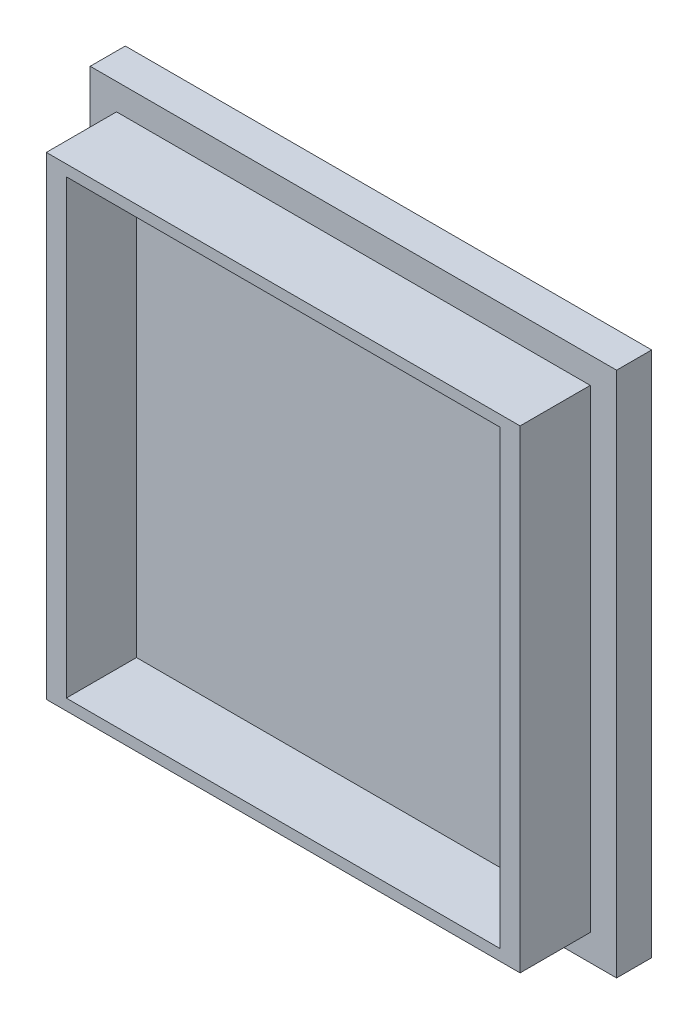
from build123d import *

# Parameters (mm, degrees)
SKETCH1_W           = 38.1
SKETCH1_H           = 38.1
BOSS_EXTRUDE1_DEPTH = 2.54
SKETCH2_W           = 34.29
SKETCH2_H           = 34.29
SKETCH2_W_2         = 31.398752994
SKETCH2_H_2         = 32.67905363
BOSS_EXTRUDE3_DEPTH = 5.08


with BuildPart() as part:
    # Sketch1 → Boss-Extrude1 (new body)
    with BuildSketch(Plane.XY):
        Rectangle(SKETCH1_W, SKETCH1_H)
    extrude(amount=BOSS_EXTRUDE1_DEPTH)

    # Sketch2 → Boss-Extrude3 (add)
    with BuildSketch(Plane.XY.offset(2.54)):
        Rectangle(SKETCH2_W, SKETCH2_H)
        Rectangle(SKETCH2_W_2, SKETCH2_H_2, mode=Mode.SUBTRACT)
    extrude(amount=BOSS_EXTRUDE3_DEPTH)


solid = part.part
